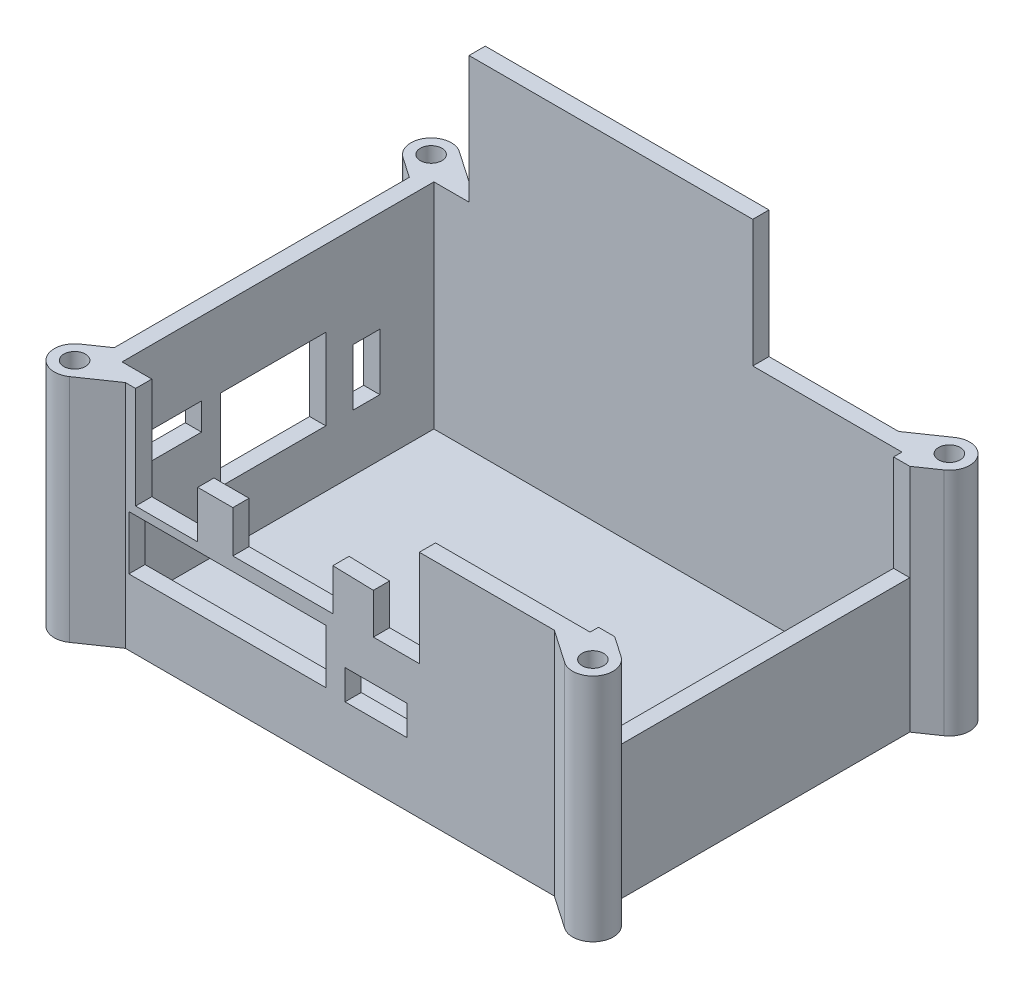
from build123d import *

# Parameters (mm, degrees)
SKETCH2_W           = 86.6
SKETCH2_H           = 57.7
BOSS_EXTRUDE2_DEPTH = 3
SKETCH2_7_R         = 2
SKETCH2_7_W         = 86.6
SKETCH2_7_H         = 57.7
BOSS_EXTRUDE3_DEPTH = 42.6
SKETCH4_W           = 5
SKETCH4_H           = 10.5
SKETCH4_W_2         = 17
SKETCH4_H_2         = 15
SKETCH4_W_3         = 7.5
SKETCH4_H_3         = 2.5
CUT_EXTRUDE1_DEPTH  = 42.6
SKETCH5_W           = 9.5
SKETCH5_H           = 3.5
SKETCH5_W_2         = 16.5
SKETCH5_H_2         = 7.75
SKETCH5_W_3         = 8.5
SKETCH5_H_3         = 7.5
SKETCH5_W_4         = 14.25
SKETCH5_H_4         = 7
CUT_EXTRUDE3_DEPTH  = 33.6
SKETCH9_W           = 54.596800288
SKETCH9_H           = 17.85
CUT_EXTRUDE4_DEPTH  = 33.6
SKETCH10_W          = 52.5
SKETCH10_H          = 23.5
BOSS_EXTRUDE4_DEPTH = 3
SKETCH11_W          = 5
SKETCH11_H          = 7
CUT_EXTRUDE5_DEPTH  = 10
SKETCH12_W          = 36.5
SKETCH12_H          = 10
CUT_EXTRUDE6_DEPTH  = 10
SKETCH13_W          = 11.5
SKETCH13_H          = 5.5
CUT_EXTRUDE7_DEPTH  = 10
SKETCH14_W          = 18.5
SKETCH14_H          = 9
CUT_EXTRUDE8_DEPTH  = 10
CUT_EXTRUDE9_DEPTH  = 10
SKETCH16_W          = 2.5
SKETCH16_H          = 15
SKETCH16_W_2        = 9.5
SKETCH16_H_2        = 5
CUT_EXTRUDE10_DEPTH = 10


with BuildPart() as part:
    # Sketch2 → Boss-Extrude2 (new body)
    with BuildSketch(Plane(origin=(0, 0, 0), x_dir=(1, 0, 0), z_dir=(0, 1, 0))):
        with Locations((-46.3, 31.85)):
            Rectangle(SKETCH2_W, SKETCH2_H)
    extrude(amount=BOSS_EXTRUDE2_DEPTH)

    # Sketch2_7 → Boss-Extrude3 (add)
    with BuildSketch(Plane(origin=(0, 0, 0), x_dir=(1, 0, 0), z_dir=(0, 1, 0))):
        with BuildLine():
            Line((-85.983388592, 63.7), (-6.616611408, 63.7))
            Line((-6.616611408, 63.7), (-0.477560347, 67.923083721))
            ThreePointArc((-0.477560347, 67.923083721), (4.737345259, 66.958843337), (3.773104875, 61.743937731))
            Line((3.773104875, 61.743937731), (0, 59.148400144))
            Line((0, 59.148400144), (0, 4.551599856))
            Line((0, 4.551599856), (3.773104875, 1.956062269))
            ThreePointArc((3.773104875, 1.956062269), (4.737345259, -3.258843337), (-0.477560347, -4.223083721))
            Line((-0.477560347, -4.223083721), (-6.616611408, 0))
            Line((-6.616611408, 0), (-85.983388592, 0))
            Line((-85.983388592, 0), (-92.122439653, -4.223083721))
            ThreePointArc((-92.122439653, -4.223083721), (-97.337345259, -3.258843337), (-96.373104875, 1.956062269))
            Line((-96.373104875, 1.956062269), (-92.6, 4.551599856))
            Line((-92.6, 4.551599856), (-92.6, 59.148400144))
            Line((-92.6, 59.148400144), (-96.373104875, 61.743937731))
            ThreePointArc((-96.373104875, 61.743937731), (-97.337345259, 66.958843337), (-92.122439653, 67.923083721))
            Line((-92.122439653, 67.923083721), (-85.983388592, 63.7))
        make_face()
        with Locations(Location((-94.247772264, 64.833510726, 0), (0, 0, 270))):
            Circle(SKETCH2_7_R, mode=Mode.SUBTRACT)
        with Locations(Location((1.647772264, 64.833510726, 0), (0, 0, 270))):
            Circle(SKETCH2_7_R, mode=Mode.SUBTRACT)
        with Locations(Location((1.647772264, -1.133510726, 0), (0, 0, 270))):
            Circle(SKETCH2_7_R, mode=Mode.SUBTRACT)
        with Locations(Location((-94.247772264, -1.133510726, 0), (0, 0, 270))):
            Circle(SKETCH2_7_R, mode=Mode.SUBTRACT)
        with Locations((-46.3, 31.85)):
            Rectangle(SKETCH2_7_W, SKETCH2_7_H, mode=Mode.SUBTRACT)
    extrude(amount=BOSS_EXTRUDE3_DEPTH)

    # Sketch4 → Cut-Extrude1 (cut)
    with BuildSketch(Plane.ZY.offset(92.6)):
        with Locations((-48.2, 18.75)):
            Rectangle(SKETCH4_W, SKETCH4_H)
        with Locations((-32.2, 21)):
            Rectangle(SKETCH4_W_2, SKETCH4_H_2)
        with Locations((-11.95, 25.25)):
            Rectangle(SKETCH4_W_3, SKETCH4_H_3)
    extrude(amount=-CUT_EXTRUDE1_DEPTH, mode=Mode.SUBTRACT)

    # Sketch5 → Cut-Extrude3 (cut)
    with BuildSketch(Plane.XY):
        Polygon((-84.1, 42.6), (-84.1, 28.25), (-74.6, 28.25), (-74.6, 32.5), (-66.1, 32.5), (-49.6, 32.5), (-40.1, 32.25), (-31.6, 32.25), (-31.6, 42.6), align=None)
        with Locations((-79.35, 26.5)):
            Rectangle(SKETCH5_W, SKETCH5_H)
        with Locations((-57.85, 28.625)):
            Rectangle(SKETCH5_W_2, SKETCH5_H_2)
        with Locations((-35.85, 28.5)):
            Rectangle(SKETCH5_W_3, SKETCH5_H_3)
        with Locations((-40.6, 15.5)):
            Rectangle(SKETCH5_W, SKETCH5_H)
        with Locations((-58.975, 17.25)):
            Rectangle(SKETCH5_W_4, SKETCH5_H_4)
        with Locations((-78.225, 17.25)):
            Rectangle(SKETCH5_W_4, SKETCH5_H_4)
    extrude(amount=-CUT_EXTRUDE3_DEPTH, mode=Mode.SUBTRACT)

    # Sketch9 → Cut-Extrude4 (cut)
    with BuildSketch(Plane(origin=(0, 0, 0), x_dir=(0, 0, -1), z_dir=(1, 0, 0))):
        with Locations((31.85, 33.675)):
            Rectangle(SKETCH9_W, SKETCH9_H)
    extrude(amount=-CUT_EXTRUDE4_DEPTH, mode=Mode.SUBTRACT)

    # Sketch10 → Boss-Extrude4 (add)
    with BuildSketch(Plane(origin=(0, 0, -63.7), x_dir=(-1, 0, 0), z_dir=(0, 0, -1))):
        with Locations((56.85, 54.35)):
            Rectangle(SKETCH10_W, SKETCH10_H)
    extrude(amount=-BOSS_EXTRUDE4_DEPTH)

    # Sketch11 → Cut-Extrude5 (cut)
    with BuildSketch(Plane.XY):
        with Locations((-68.6, 17.25)):
            Rectangle(SKETCH11_W, SKETCH11_H)
    extrude(amount=-CUT_EXTRUDE5_DEPTH, mode=Mode.SUBTRACT)

    # Sketch12 → Cut-Extrude6 (cut)
    with BuildSketch(Plane.XY):
        with Locations((-67.1, 17.25)):
            Rectangle(SKETCH12_W, SKETCH12_H)
    extrude(amount=-CUT_EXTRUDE6_DEPTH, mode=Mode.SUBTRACT)

    # Sketch13 → Cut-Extrude7 (cut)
    with BuildSketch(Plane.XY):
        with Locations((-39.6, 14.5)):
            Rectangle(SKETCH13_W, SKETCH13_H)
    extrude(amount=-CUT_EXTRUDE7_DEPTH, mode=Mode.SUBTRACT)

    # Sketch14 → Cut-Extrude8 (cut)
    with BuildSketch(Plane.XY):
        with Locations((-56.85, 29.25)):
            Rectangle(SKETCH14_W, SKETCH14_H)
    extrude(amount=-CUT_EXTRUDE8_DEPTH, mode=Mode.SUBTRACT)

    # Sketch15 → Cut-Extrude9 (cut)
    with BuildSketch(Plane.XY):
        Polygon((-84.1, 24.75), (-84.1, 23.75), (-72.6, 23.75), (-72.6, 33.75), (-74.6, 33.75), (-74.6, 24.75), align=None)
    extrude(amount=-CUT_EXTRUDE9_DEPTH, mode=Mode.SUBTRACT)

    # Sketch16 → Cut-Extrude10 (cut)
    with BuildSketch(Plane.ZY.offset(92.6)):
        with Locations((-22.45, 21)):
            Rectangle(SKETCH16_W, SKETCH16_H)
        with Locations((-12.95, 26.5)):
            Rectangle(SKETCH16_W_2, SKETCH16_H_2)
    extrude(amount=-CUT_EXTRUDE10_DEPTH, mode=Mode.SUBTRACT)


solid = part.part
